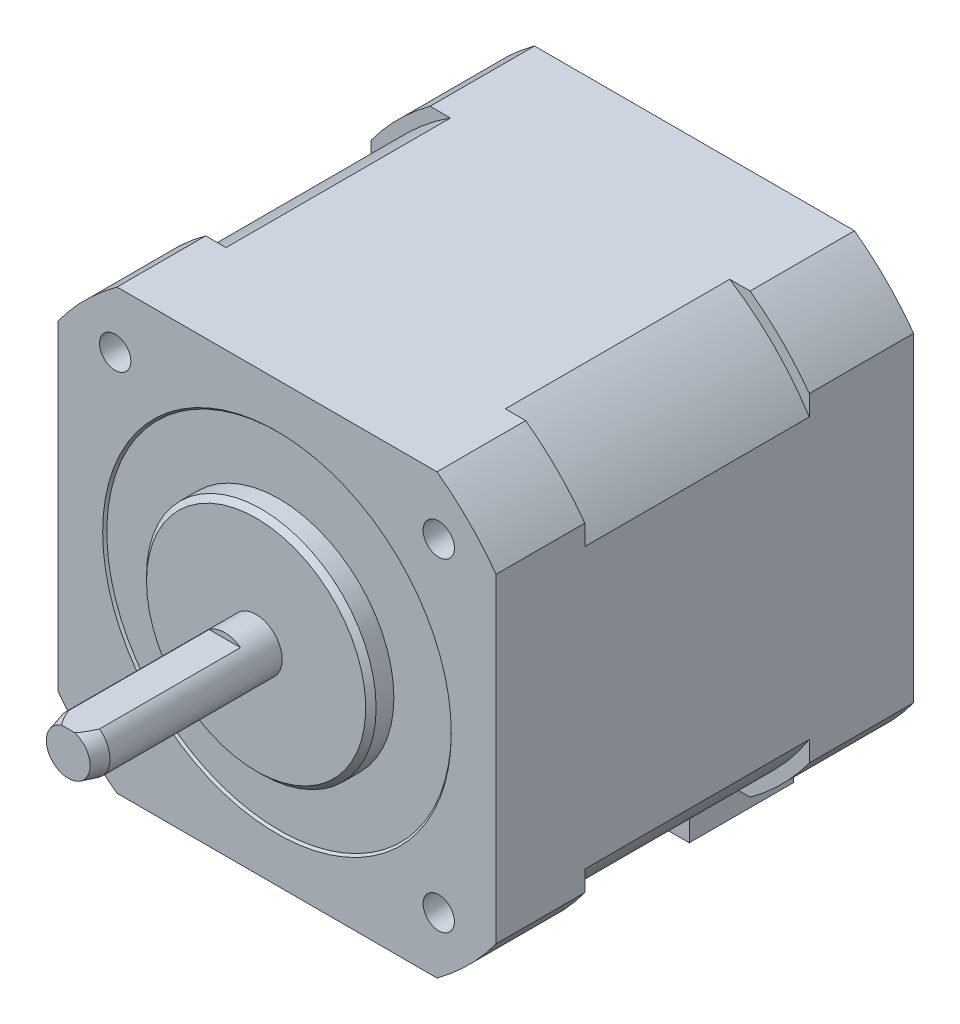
ISO-10303-21;
HEADER;
FILE_DESCRIPTION(('STEP AP214'),'2;1');
FILE_NAME('part.step','',(''),(''),'','','');
FILE_SCHEMA(('AUTOMOTIVE_DESIGN { 1 0 10303 214 1 1 1 1 }'));
ENDSEC;
DATA;
#1=APPLICATION_CONTEXT('core data for automotive mechanical design processes');
#2=APPLICATION_PROTOCOL_DEFINITION('international standard','automotive_design',2000,#1);
#3=PRODUCT_CONTEXT('',#1,'mechanical');
#4=PRODUCT('Part','Part','',(#3));
#5=PRODUCT_RELATED_PRODUCT_CATEGORY('part','',(#4));
#6=PRODUCT_DEFINITION_FORMATION('','',#4);
#7=PRODUCT_DEFINITION_CONTEXT('part definition',#1,'design');
#8=PRODUCT_DEFINITION('design','',#6,#7);
#9=PRODUCT_DEFINITION_SHAPE('','',#8);
#10=(LENGTH_UNIT() NAMED_UNIT(*) SI_UNIT(.MILLI.,.METRE.));
#11=(NAMED_UNIT(*) PLANE_ANGLE_UNIT() SI_UNIT($,.RADIAN.));
#12=(NAMED_UNIT(*) SI_UNIT($,.STERADIAN.) SOLID_ANGLE_UNIT());
#13=UNCERTAINTY_MEASURE_WITH_UNIT(LENGTH_MEASURE(1.E-05),#10,'distance_accuracy_value','');
#14=(GEOMETRIC_REPRESENTATION_CONTEXT(3) GLOBAL_UNCERTAINTY_ASSIGNED_CONTEXT((#13)) GLOBAL_UNIT_ASSIGNED_CONTEXT((#10,
#11,#12)) REPRESENTATION_CONTEXT('',''));
#15=CARTESIAN_POINT('',(0.,0.,0.));
#16=DIRECTION('',(0.,0.,1.));
#17=DIRECTION('',(1.,0.,0.));
#18=AXIS2_PLACEMENT_3D('',#15,#16,#17);
#19=CARTESIAN_POINT('',(21.,-21.,-10.5));
#20=DIRECTION('',(0.,1.,0.));
#21=DIRECTION('',(-1.,0.,0.));
#22=AXIS2_PLACEMENT_3D('',#19,#20,#21);
#23=PLANE('',#22);
#24=DIRECTION('',(0.,0.,-1.));
#25=VECTOR('',#24,1.);
#26=CARTESIAN_POINT('',(-9.5,-21.,-32.));
#27=LINE('',#26,#25);
#28=CARTESIAN_POINT('',(-9.5,-21.,-32.));
#29=VERTEX_POINT('',#28);
#30=CARTESIAN_POINT('',(-9.5,-21.0000000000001,-42.));
#31=VERTEX_POINT('',#30);
#32=EDGE_CURVE('E42',#29,#31,#27,.T.);
#33=ORIENTED_EDGE('',*,*,#32,.F.);
#34=DIRECTION('',(-1.,0.,0.));
#35=VECTOR('',#34,1.);
#36=CARTESIAN_POINT('',(-9.5,-21.,-32.));
#37=LINE('',#36,#35);
#38=CARTESIAN_POINT('',(9.5,-21.,-32.));
#39=VERTEX_POINT('',#38);
#40=EDGE_CURVE('E262',#39,#29,#37,.T.);
#41=ORIENTED_EDGE('',*,*,#40,.F.);
#42=DIRECTION('',(0.,0.,1.));
#43=VECTOR('',#42,1.);
#44=CARTESIAN_POINT('',(9.5,-21.,-32.));
#45=LINE('',#44,#43);
#46=CARTESIAN_POINT('',(9.5,-21.,-42.));
#47=VERTEX_POINT('',#46);
#48=EDGE_CURVE('E278',#47,#39,#45,.T.);
#49=ORIENTED_EDGE('',*,*,#48,.F.);
#50=DIRECTION('',(-1.,0.,0.));
#51=VECTOR('',#50,1.);
#52=CARTESIAN_POINT('',(15.3297097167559,-21.,-42.));
#53=LINE('',#52,#51);
#54=CARTESIAN_POINT('',(15.3297097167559,-21.,-42.));
#55=VERTEX_POINT('',#54);
#56=EDGE_CURVE('E283',#55,#47,#53,.T.);
#57=ORIENTED_EDGE('',*,*,#56,.F.);
#58=DIRECTION('',(0.,0.,1.));
#59=VECTOR('',#58,1.);
#60=CARTESIAN_POINT('',(15.3297097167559,-21.,-42.));
#61=LINE('',#60,#59);
#62=CARTESIAN_POINT('',(15.3297097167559,-21.,-32.));
#63=VERTEX_POINT('',#62);
#64=EDGE_CURVE('E356',#55,#63,#61,.T.);
#65=ORIENTED_EDGE('',*,*,#64,.T.);
#66=DIRECTION('',(-1.,0.,0.));
#67=VECTOR('',#66,1.);
#68=CARTESIAN_POINT('',(-13.3794618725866,-21.,-32.));
#69=LINE('',#68,#67);
#70=CARTESIAN_POINT('',(13.3794618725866,-21.,-32.));
#71=VERTEX_POINT('',#70);
#72=EDGE_CURVE('E317',#63,#71,#69,.T.);
#73=ORIENTED_EDGE('',*,*,#72,.T.);
#74=DIRECTION('',(0.,0.,1.));
#75=VECTOR('',#74,1.);
#76=CARTESIAN_POINT('',(13.3794618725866,-21.,-32.));
#77=LINE('',#76,#75);
#78=CARTESIAN_POINT('',(13.3794618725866,-21.,-10.5));
#79=VERTEX_POINT('',#78);
#80=EDGE_CURVE('E724',#71,#79,#77,.T.);
#81=ORIENTED_EDGE('',*,*,#80,.T.);
#82=DIRECTION('',(-1.,0.,0.));
#83=VECTOR('',#82,1.);
#84=CARTESIAN_POINT('',(21.,-21.,-10.5));
#85=LINE('',#84,#83);
#86=CARTESIAN_POINT('',(15.3297097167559,-21.,-10.5));
#87=VERTEX_POINT('',#86);
#88=EDGE_CURVE('E563',#87,#79,#85,.T.);
#89=ORIENTED_EDGE('',*,*,#88,.F.);
#90=DIRECTION('',(0.,0.,1.));
#91=VECTOR('',#90,1.);
#92=CARTESIAN_POINT('',(15.3297097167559,-21.,-36.));
#93=LINE('',#92,#91);
#94=CARTESIAN_POINT('',(15.3297097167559,-21.,-2.));
#95=VERTEX_POINT('',#94);
#96=EDGE_CURVE('E625',#95,#87,#93,.F.);
#97=ORIENTED_EDGE('',*,*,#96,.F.);
#98=DIRECTION('',(-1.,0.,0.));
#99=VECTOR('',#98,1.);
#100=CARTESIAN_POINT('',(21.,-21.,-2.));
#101=LINE('',#100,#99);
#102=CARTESIAN_POINT('',(-15.3297097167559,-21.,-2.));
#103=VERTEX_POINT('',#102);
#104=EDGE_CURVE('E571',#95,#103,#101,.T.);
#105=ORIENTED_EDGE('',*,*,#104,.T.);
#106=DIRECTION('',(0.,0.,1.));
#107=VECTOR('',#106,1.);
#108=CARTESIAN_POINT('',(-15.3297097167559,-21.,-36.));
#109=LINE('',#108,#107);
#110=CARTESIAN_POINT('',(-15.3297097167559,-21.,-10.5));
#111=VERTEX_POINT('',#110);
#112=EDGE_CURVE('E629',#111,#103,#109,.T.);
#113=ORIENTED_EDGE('',*,*,#112,.F.);
#114=CARTESIAN_POINT('',(-13.3794618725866,-21.,-10.5));
#115=VERTEX_POINT('',#114);
#116=EDGE_CURVE('E568',#115,#111,#85,.T.);
#117=ORIENTED_EDGE('',*,*,#116,.F.);
#118=DIRECTION('',(0.,0.,1.));
#119=VECTOR('',#118,1.);
#120=CARTESIAN_POINT('',(-13.3794618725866,-21.,-32.));
#121=LINE('',#120,#119);
#122=CARTESIAN_POINT('',(-13.3794618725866,-21.,-32.));
#123=VERTEX_POINT('',#122);
#124=EDGE_CURVE('E725',#123,#115,#121,.T.);
#125=ORIENTED_EDGE('',*,*,#124,.F.);
#126=CARTESIAN_POINT('',(-15.3297097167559,-21.,-32.));
#127=VERTEX_POINT('',#126);
#128=EDGE_CURVE('E315',#123,#127,#69,.T.);
#129=ORIENTED_EDGE('',*,*,#128,.T.);
#130=DIRECTION('',(0.,0.,1.));
#131=VECTOR('',#130,1.);
#132=CARTESIAN_POINT('',(-15.3297097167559,-21.,-42.));
#133=LINE('',#132,#131);
#134=CARTESIAN_POINT('',(-15.3297097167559,-21.,-42.));
#135=VERTEX_POINT('',#134);
#136=EDGE_CURVE('E353',#135,#127,#133,.T.);
#137=ORIENTED_EDGE('',*,*,#136,.F.);
#138=EDGE_CURVE('E60',#31,#135,#53,.T.);
#139=ORIENTED_EDGE('',*,*,#138,.F.);
#140=EDGE_LOOP('',(#33,#41,#49,#57,#65,#73,#81,#89,#97,#105,#113,#117,#125,#129,#137,#139));
#141=FACE_BOUND('',#140,.T.);
#142=ADVANCED_FACE('F38',(#141),#23,.F.);
#143=CARTESIAN_POINT('',(0.,0.,18.));
#144=DIRECTION('',(0.,0.,-1.));
#145=DIRECTION('',(-1.,0.,0.));
#146=AXIS2_PLACEMENT_3D('',#143,#144,#145);
#147=CYLINDRICAL_SURFACE('',#146,2.5);
#148=CARTESIAN_POINT('',(0.,0.,16.4999999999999));
#149=DIRECTION('',(0.,0.,1.));
#150=DIRECTION('',(1.,0.,0.));
#151=AXIS2_PLACEMENT_3D('',#148,#149,#150);
#152=CIRCLE('',#151,2.5);
#153=CARTESIAN_POINT('',(1.5,2.,16.4999999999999));
#154=VERTEX_POINT('',#153);
#155=CARTESIAN_POINT('',(-1.49999999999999,2.,16.4999999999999));
#156=VERTEX_POINT('',#155);
#157=EDGE_CURVE('E407',#154,#156,#152,.F.);
#158=ORIENTED_EDGE('',*,*,#157,.T.);
#159=DIRECTION('',(0.,0.,-1.));
#160=VECTOR('',#159,1.);
#161=CARTESIAN_POINT('',(-1.5,2.,18.));
#162=LINE('',#161,#160);
#163=CARTESIAN_POINT('',(-1.5,2.,3.));
#164=VERTEX_POINT('',#163);
#165=EDGE_CURVE('E303',#156,#164,#162,.T.);
#166=ORIENTED_EDGE('',*,*,#165,.T.);
#167=CARTESIAN_POINT('',(0.,0.,3.));
#168=DIRECTION('',(0.,0.,1.));
#169=DIRECTION('',(1.,0.,0.));
#170=AXIS2_PLACEMENT_3D('',#167,#168,#169);
#171=CIRCLE('',#170,2.5);
#172=CARTESIAN_POINT('',(1.5,2.,3.));
#173=VERTEX_POINT('',#172);
#174=EDGE_CURVE('E419',#173,#164,#171,.T.);
#175=ORIENTED_EDGE('',*,*,#174,.F.);
#176=DIRECTION('',(0.,0.,-1.));
#177=VECTOR('',#176,1.);
#178=CARTESIAN_POINT('',(1.5,2.,18.));
#179=LINE('',#178,#177);
#180=EDGE_CURVE('E756',#173,#154,#179,.F.);
#181=ORIENTED_EDGE('',*,*,#180,.T.);
#182=EDGE_LOOP('',(#158,#166,#175,#181));
#183=FACE_BOUND('',#182,.T.);
#184=CARTESIAN_POINT('',(0.,0.,0.));
#185=DIRECTION('',(0.,0.,-1.));
#186=DIRECTION('',(-1.,0.,0.));
#187=AXIS2_PLACEMENT_3D('',#184,#185,#186);
#188=CIRCLE('',#187,2.5);
#189=CARTESIAN_POINT('',(-2.5,0.,0.));
#190=VERTEX_POINT('',#189);
#191=EDGE_CURVE('E560',#190,#190,#188,.T.);
#192=ORIENTED_EDGE('',*,*,#191,.F.);
#193=EDGE_LOOP('',(#192));
#194=FACE_BOUND('',#193,.T.);
#195=ADVANCED_FACE('F528',(#183,#194),#147,.T.);
#196=CARTESIAN_POINT('',(0.,0.,18.));
#197=DIRECTION('',(0.,0.,1.));
#198=DIRECTION('',(1.,0.,0.));
#199=AXIS2_PLACEMENT_3D('',#196,#197,#198);
#200=PLANE('',#199);
#201=DIRECTION('',(1.,0.,0.));
#202=VECTOR('',#201,1.);
#203=CARTESIAN_POINT('',(-4.72781232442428,2.,18.));
#204=LINE('',#203,#202);
#205=CARTESIAN_POINT('',(-0.633974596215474,2.,18.));
#206=VERTEX_POINT('',#205);
#207=CARTESIAN_POINT('',(0.633974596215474,2.,18.));
#208=VERTEX_POINT('',#207);
#209=EDGE_CURVE('E759',#206,#208,#204,.T.);
#210=ORIENTED_EDGE('',*,*,#209,.F.);
#211=CARTESIAN_POINT('',(0.,0.,18.));
#212=DIRECTION('',(0.,0.,1.));
#213=DIRECTION('',(1.,0.,0.));
#214=AXIS2_PLACEMENT_3D('',#211,#212,#213);
#215=CIRCLE('',#214,2.09807621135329);
#216=EDGE_CURVE('E404',#206,#208,#215,.T.);
#217=ORIENTED_EDGE('',*,*,#216,.T.);
#218=EDGE_LOOP('',(#210,#217));
#219=FACE_BOUND('',#218,.T.);
#220=ADVANCED_FACE('F543',(#219),#200,.T.);
#221=CARTESIAN_POINT('',(0.,0.,0.));
#222=DIRECTION('',(0.,0.,-1.));
#223=DIRECTION('',(-1.,0.,0.));
#224=AXIS2_PLACEMENT_3D('',#221,#222,#223);
#225=PLANE('',#224);
#226=CARTESIAN_POINT('',(0.,0.,0.));
#227=DIRECTION('',(0.,0.,-1.));
#228=DIRECTION('',(-1.,0.,0.));
#229=AXIS2_PLACEMENT_3D('',#226,#227,#228);
#230=CIRCLE('',#229,10.5);
#231=CARTESIAN_POINT('',(-10.5,0.,0.));
#232=VERTEX_POINT('',#231);
#233=EDGE_CURVE('E48',#232,#232,#230,.F.);
#234=ORIENTED_EDGE('',*,*,#233,.T.);
#235=EDGE_LOOP('',(#234));
#236=FACE_BOUND('',#235,.T.);
#237=ORIENTED_EDGE('',*,*,#191,.T.);
#238=EDGE_LOOP('',(#237));
#239=FACE_BOUND('',#238,.T.);
#240=ADVANCED_FACE('F539',(#236,#239),#225,.F.);
#241=CARTESIAN_POINT('',(0.,0.,-2.));
#242=DIRECTION('',(0.,0.,1.));
#243=DIRECTION('',(1.,0.,0.));
#244=AXIS2_PLACEMENT_3D('',#241,#242,#243);
#245=CYLINDRICAL_SURFACE('',#244,11.);
#246=CARTESIAN_POINT('',(0.,0.,-0.499999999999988));
#247=DIRECTION('',(0.,0.,-1.));
#248=DIRECTION('',(-1.,0.,0.));
#249=AXIS2_PLACEMENT_3D('',#246,#247,#248);
#250=CIRCLE('',#249,11.);
#251=CARTESIAN_POINT('',(-11.,0.,-0.499999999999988));
#252=VERTEX_POINT('',#251);
#253=EDGE_CURVE('E825',#252,#252,#250,.T.);
#254=ORIENTED_EDGE('',*,*,#253,.T.);
#255=EDGE_LOOP('',(#254));
#256=FACE_BOUND('',#255,.T.);
#257=CARTESIAN_POINT('',(0.,0.,-2.2));
#258=DIRECTION('',(0.,0.,1.));
#259=DIRECTION('',(1.,0.,0.));
#260=AXIS2_PLACEMENT_3D('',#257,#258,#259);
#261=CIRCLE('',#260,11.);
#262=CARTESIAN_POINT('',(11.,0.,-2.2));
#263=VERTEX_POINT('',#262);
#264=EDGE_CURVE('E265',#263,#263,#261,.T.);
#265=ORIENTED_EDGE('',*,*,#264,.T.);
#266=EDGE_LOOP('',(#265));
#267=FACE_BOUND('',#266,.T.);
#268=ADVANCED_FACE('F542',(#256,#267),#245,.T.);
#269=CARTESIAN_POINT('',(0.,0.,18.));
#270=DIRECTION('',(0.,0.,-1.));
#271=DIRECTION('',(-1.,0.,0.));
#272=AXIS2_PLACEMENT_3D('',#269,#270,#271);
#273=CONICAL_SURFACE('',#272,2.09807621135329,0.261799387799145);
#274=CARTESIAN_POINT('',(-2.67411513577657,2.,13.3677080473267));
#275=CARTESIAN_POINT('',(-2.63311786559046,2.,13.4902257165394));
#276=CARTESIAN_POINT('',(-2.59182160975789,2.,13.6126436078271));
#277=CARTESIAN_POINT('',(-2.50853023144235,2.,13.8572444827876));
#278=CARTESIAN_POINT('',(-2.46653509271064,2.,13.9794274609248));
#279=CARTESIAN_POINT('',(-2.33928264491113,2.,14.34576464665));
#280=CARTESIAN_POINT('',(-2.25282589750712,2.,14.5895039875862));
#281=CARTESIAN_POINT('',(-2.07457613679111,2.,15.0781045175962));
#282=CARTESIAN_POINT('',(-1.98273458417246,2.,15.3229481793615));
#283=CARTESIAN_POINT('',(-1.84011140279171,2.,15.688262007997));
#284=CARTESIAN_POINT('',(-1.79177038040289,2.,15.8096838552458));
#285=CARTESIAN_POINT('',(-1.6930545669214,2.,16.0516959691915));
#286=CARTESIAN_POINT('',(-1.64267985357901,2.,16.1722862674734));
#287=CARTESIAN_POINT('',(-1.53950262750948,2.,16.4120087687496));
#288=CARTESIAN_POINT('',(-1.4867076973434,2.,16.5311442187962));
#289=CARTESIAN_POINT('',(-1.37773401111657,2.,16.7679408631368));
#290=CARTESIAN_POINT('',(-1.32155357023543,2.,16.8856012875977));
#291=CARTESIAN_POINT('',(-1.20458285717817,2.,17.1187131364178));
#292=CARTESIAN_POINT('',(-1.14379017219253,2.,17.2341633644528));
#293=CARTESIAN_POINT('',(-1.01570284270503,2.,17.4612984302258));
#294=CARTESIAN_POINT('',(-0.948415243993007,2.,17.5729871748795));
#295=CARTESIAN_POINT('',(-0.817363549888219,2.,17.7692701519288));
#296=CARTESIAN_POINT('',(-0.755348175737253,2.,17.8549879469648));
#297=CARTESIAN_POINT('',(-0.654778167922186,2.,17.9770588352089));
#298=CARTESIAN_POINT('',(-0.620094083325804,2.,18.0165731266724));
#299=CARTESIAN_POINT('',(-0.547506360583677,2.,18.092493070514));
#300=CARTESIAN_POINT('',(-0.509607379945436,2.,18.1289030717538));
#301=CARTESIAN_POINT('',(-0.439829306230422,2.,18.1884315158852));
#302=CARTESIAN_POINT('',(-0.40884422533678,2.,18.212585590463));
#303=CARTESIAN_POINT('',(-0.344218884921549,2.,18.2572111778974));
#304=CARTESIAN_POINT('',(-0.310575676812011,2.,18.2776785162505));
#305=CARTESIAN_POINT('',(-0.240012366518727,2.,18.3136158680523));
#306=CARTESIAN_POINT('',(-0.203051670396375,2.,18.3290087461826));
#307=CARTESIAN_POINT('',(-0.126881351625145,2.,18.3523462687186));
#308=CARTESIAN_POINT('',(-0.0876800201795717,2.,18.3603166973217));
#309=CARTESIAN_POINT('',(-0.0127311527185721,2.,18.367039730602));
#310=CARTESIAN_POINT('',(0.0229341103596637,2.,18.3666919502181));
#311=CARTESIAN_POINT('',(0.0935290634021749,2.,18.3590326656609));
#312=CARTESIAN_POINT('',(0.128457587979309,2.,18.3517108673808));
#313=CARTESIAN_POINT('',(0.201815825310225,2.,18.329553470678));
#314=CARTESIAN_POINT('',(0.239935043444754,2.,18.3137192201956));
#315=CARTESIAN_POINT('',(0.313185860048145,2.,18.276283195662));
#316=CARTESIAN_POINT('',(0.348311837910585,2.,18.2546708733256));
#317=CARTESIAN_POINT('',(0.443923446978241,2.,18.1877621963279));
#318=CARTESIAN_POINT('',(0.501075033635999,2.,18.1377652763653));
#319=CARTESIAN_POINT('',(0.581429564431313,2.,18.0575943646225));
#320=CARTESIAN_POINT('',(0.60737285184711,2.,18.0299378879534));
#321=CARTESIAN_POINT('',(0.657731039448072,2.,17.9732675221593));
#322=CARTESIAN_POINT('',(0.682146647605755,2.,17.9442542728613));
#323=CARTESIAN_POINT('',(0.749893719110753,2.,17.8601101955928));
#324=CARTESIAN_POINT('',(0.791668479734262,2.,17.8037362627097));
#325=CARTESIAN_POINT('',(0.871939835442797,2.,17.6886841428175));
#326=CARTESIAN_POINT('',(0.91043426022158,2.,17.6300044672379));
#327=CARTESIAN_POINT('',(0.984949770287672,2.,17.5109259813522));
#328=CARTESIAN_POINT('',(1.02096523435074,2.,17.4505236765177));
#329=CARTESIAN_POINT('',(1.09096213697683,2.,17.3285472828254));
#330=CARTESIAN_POINT('',(1.12494324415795,2.,17.2669730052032));
#331=CARTESIAN_POINT('',(1.22495399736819,2.,17.0799665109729));
#332=CARTESIAN_POINT('',(1.2884786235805,2.,16.9531970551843));
#333=CARTESIAN_POINT('',(1.41085483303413,2.,16.6976781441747));
#334=CARTESIAN_POINT('',(1.46971282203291,2.,16.5689317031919));
#335=CARTESIAN_POINT('',(1.58310001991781,2.,16.3121463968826));
#336=CARTESIAN_POINT('',(1.63768554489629,2.,16.1841322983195));
#337=CARTESIAN_POINT('',(1.7443631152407,2.,15.9270663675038));
#338=CARTESIAN_POINT('',(1.79645500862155,2.,15.7980144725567));
#339=CARTESIAN_POINT('',(1.94989108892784,2.,15.4094944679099));
#340=CARTESIAN_POINT('',(2.04830566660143,2.,15.1488712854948));
#341=CARTESIAN_POINT('',(2.23648040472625,2.,14.6352664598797));
#342=CARTESIAN_POINT('',(2.32642514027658,2.,14.3823515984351));
#343=CARTESIAN_POINT('',(2.45867006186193,2.,14.0022493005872));
#344=CARTESIAN_POINT('',(2.50227709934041,2.,13.8755147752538));
#345=CARTESIAN_POINT('',(2.58873482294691,2.,13.6217918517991));
#346=CARTESIAN_POINT('',(2.63158553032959,2.,13.4948034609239));
#347=CARTESIAN_POINT('',(2.67411513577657,2.,13.3677080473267));
#348=B_SPLINE_CURVE_WITH_KNOTS('',3,(#274,#275,#276,#277,#278,#279,#280,#281,#282,#283,#284,
#285,#286,#287,#288,#289,#290,#291,#292,#293,#294,#295,#296,#297,#298,#299,#300,#301,#302,#303,
#304,#305,#306,#307,#308,#309,#310,#311,#312,#313,#314,#315,#316,#317,#318,#319,#320,#321,#322,
#323,#324,#325,#326,#327,#328,#329,#330,#331,#332,#333,#334,#335,#336,#337,#338,#339,#340,#341,
#342,#343,#344,#345,#346,#347),.UNSPECIFIED.,.F.,.F.,(4,2,2,2,2,2,2,2,2,2,2,2,2,2,2,2,2,2,2,2,2,
2,2,2,2,2,2,2,2,2,2,2,2,2,2,2,4),(0.,0.387584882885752,0.775178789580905,1.5510087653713,
2.33544116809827,2.72750017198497,3.11954420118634,3.51043426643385,3.90152049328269,
4.2928127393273,4.68368517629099,5.00048531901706,5.15809093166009,5.31547199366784,
5.4331414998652,5.55094341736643,5.67046127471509,5.78956238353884,5.89584731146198,
6.00228936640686,6.12543181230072,6.24880061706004,6.47525140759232,6.58900607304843,
6.70270762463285,6.91302983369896,7.12349013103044,7.33441292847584,7.54536999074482,
7.97059745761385,8.3952307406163,8.81269313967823,9.23018095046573,10.0658395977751,
10.8711084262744,11.2731870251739,11.675254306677),.UNSPECIFIED.);
#349=EDGE_CURVE('E418',#156,#206,#348,.T.);
#350=ORIENTED_EDGE('',*,*,#349,.F.);
#351=ORIENTED_EDGE('',*,*,#157,.F.);
#352=EDGE_CURVE('E411',#208,#154,#348,.T.);
#353=ORIENTED_EDGE('',*,*,#352,.F.);
#354=ORIENTED_EDGE('',*,*,#216,.F.);
#355=EDGE_LOOP('',(#350,#351,#353,#354));
#356=FACE_BOUND('',#355,.T.);
#357=ADVANCED_FACE('F421',(#356),#273,.T.);
#358=CARTESIAN_POINT('',(0.,0.,3.));
#359=DIRECTION('',(0.,0.,1.));
#360=DIRECTION('',(1.,0.,0.));
#361=AXIS2_PLACEMENT_3D('',#358,#359,#360);
#362=PLANE('',#361);
#363=ORIENTED_EDGE('',*,*,#174,.T.);
#364=DIRECTION('',(1.,0.,0.));
#365=VECTOR('',#364,1.);
#366=CARTESIAN_POINT('',(-4.72781232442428,2.,3.));
#367=LINE('',#366,#365);
#368=EDGE_CURVE('E758',#164,#173,#367,.T.);
#369=ORIENTED_EDGE('',*,*,#368,.T.);
#370=EDGE_LOOP('',(#363,#369));
#371=FACE_BOUND('',#370,.T.);
#372=ADVANCED_FACE('F430',(#371),#362,.T.);
#373=CARTESIAN_POINT('',(-4.72781232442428,2.,3.));
#374=DIRECTION('',(0.,-1.,0.));
#375=DIRECTION('',(0.,0.,-1.));
#376=AXIS2_PLACEMENT_3D('',#373,#374,#375);
#377=PLANE('',#376);
#378=ORIENTED_EDGE('',*,*,#349,.T.);
#379=ORIENTED_EDGE('',*,*,#209,.T.);
#380=ORIENTED_EDGE('',*,*,#352,.T.);
#381=ORIENTED_EDGE('',*,*,#180,.F.);
#382=ORIENTED_EDGE('',*,*,#368,.F.);
#383=ORIENTED_EDGE('',*,*,#165,.F.);
#384=EDGE_LOOP('',(#378,#379,#380,#381,#382,#383));
#385=FACE_BOUND('',#384,.T.);
#386=ADVANCED_FACE('F424',(#385),#377,.F.);
#387=CARTESIAN_POINT('',(0.,0.,-2.2));
#388=DIRECTION('',(0.,0.,1.));
#389=DIRECTION('',(1.,0.,0.));
#390=AXIS2_PLACEMENT_3D('',#387,#388,#389);
#391=PLANE('',#390);
#392=ORIENTED_EDGE('',*,*,#264,.F.);
#393=EDGE_LOOP('',(#392));
#394=FACE_BOUND('',#393,.T.);
#395=CARTESIAN_POINT('',(0.,0.,-2.2));
#396=DIRECTION('',(0.,0.,1.));
#397=DIRECTION('',(1.,0.,0.));
#398=AXIS2_PLACEMENT_3D('',#395,#396,#397);
#399=CIRCLE('',#398,16.5);
#400=CARTESIAN_POINT('',(16.5,0.,-2.2));
#401=VERTEX_POINT('',#400);
#402=EDGE_CURVE('E268',#401,#401,#399,.T.);
#403=ORIENTED_EDGE('',*,*,#402,.T.);
#404=EDGE_LOOP('',(#403));
#405=FACE_BOUND('',#404,.T.);
#406=ADVANCED_FACE('F429',(#394,#405),#391,.T.);
#407=CARTESIAN_POINT('',(-21.,-21.,-10.5));
#408=DIRECTION('',(0.,0.,-1.));
#409=DIRECTION('',(-1.,0.,0.));
#410=AXIS2_PLACEMENT_3D('',#407,#408,#409);
#411=PLANE('',#410);
#412=CARTESIAN_POINT('',(0.,0.,-10.5));
#413=DIRECTION('',(0.,0.,-1.));
#414=DIRECTION('',(-1.,0.,0.));
#415=AXIS2_PLACEMENT_3D('',#412,#413,#414);
#416=CIRCLE('',#415,24.9);
#417=CARTESIAN_POINT('',(13.3794618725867,21.,-10.5));
#418=VERTEX_POINT('',#417);
#419=CARTESIAN_POINT('',(21.,13.3794618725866,-10.5));
#420=VERTEX_POINT('',#419);
#421=EDGE_CURVE('E402',#418,#420,#416,.T.);
#422=ORIENTED_EDGE('',*,*,#421,.F.);
#423=DIRECTION('',(1.,0.,0.));
#424=VECTOR('',#423,1.);
#425=CARTESIAN_POINT('',(21.,21.,-10.5));
#426=LINE('',#425,#424);
#427=CARTESIAN_POINT('',(15.3297097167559,21.,-10.5));
#428=VERTEX_POINT('',#427);
#429=EDGE_CURVE('E577',#418,#428,#426,.T.);
#430=ORIENTED_EDGE('',*,*,#429,.T.);
#431=CARTESIAN_POINT('',(0.,0.,-10.5));
#432=DIRECTION('',(0.,0.,-1.));
#433=DIRECTION('',(-1.,0.,0.));
#434=AXIS2_PLACEMENT_3D('',#431,#432,#433);
#435=CIRCLE('',#434,26.);
#436=CARTESIAN_POINT('',(21.,15.3297097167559,-10.5));
#437=VERTEX_POINT('',#436);
#438=EDGE_CURVE('E605',#428,#437,#435,.T.);
#439=ORIENTED_EDGE('',*,*,#438,.T.);
#440=DIRECTION('',(0.,-1.,0.));
#441=VECTOR('',#440,1.);
#442=CARTESIAN_POINT('',(21.,21.,-10.5));
#443=LINE('',#442,#441);
#444=EDGE_CURVE('E599',#437,#420,#443,.T.);
#445=ORIENTED_EDGE('',*,*,#444,.T.);
#446=EDGE_LOOP('',(#422,#430,#439,#445));
#447=FACE_BOUND('',#446,.T.);
#448=ADVANCED_FACE('F500',(#447),#411,.T.);
#449=CARTESIAN_POINT('',(0.,0.,-32.));
#450=DIRECTION('',(0.,0.,1.));
#451=DIRECTION('',(1.,0.,0.));
#452=AXIS2_PLACEMENT_3D('',#449,#450,#451);
#453=CYLINDRICAL_SURFACE('',#452,24.9);
#454=ORIENTED_EDGE('',*,*,#421,.T.);
#455=DIRECTION('',(0.,0.,1.));
#456=VECTOR('',#455,1.);
#457=CARTESIAN_POINT('',(21.,13.3794618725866,-32.));
#458=LINE('',#457,#456);
#459=CARTESIAN_POINT('',(21.0000000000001,13.3794618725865,-32.));
#460=VERTEX_POINT('',#459);
#461=EDGE_CURVE('E645',#460,#420,#458,.T.);
#462=ORIENTED_EDGE('',*,*,#461,.F.);
#463=CARTESIAN_POINT('',(0.,0.,-32.));
#464=DIRECTION('',(0.,0.,-1.));
#465=DIRECTION('',(-1.,0.,0.));
#466=AXIS2_PLACEMENT_3D('',#463,#464,#465);
#467=CIRCLE('',#466,24.9);
#468=CARTESIAN_POINT('',(13.3794618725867,21.,-32.));
#469=VERTEX_POINT('',#468);
#470=EDGE_CURVE('E668',#469,#460,#467,.T.);
#471=ORIENTED_EDGE('',*,*,#470,.F.);
#472=DIRECTION('',(0.,0.,1.));
#473=VECTOR('',#472,1.);
#474=CARTESIAN_POINT('',(13.3794618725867,21.,-32.));
#475=LINE('',#474,#473);
#476=EDGE_CURVE('E648',#469,#418,#475,.T.);
#477=ORIENTED_EDGE('',*,*,#476,.T.);
#478=EDGE_LOOP('',(#454,#462,#471,#477));
#479=FACE_BOUND('',#478,.T.);
#480=ADVANCED_FACE('F497',(#479),#453,.T.);
#481=CARTESIAN_POINT('',(0.,0.,-32.));
#482=DIRECTION('',(0.,0.,-1.));
#483=DIRECTION('',(-1.,0.,0.));
#484=AXIS2_PLACEMENT_3D('',#481,#482,#483);
#485=PLANE('',#484);
#486=DIRECTION('',(1.,0.,0.));
#487=VECTOR('',#486,1.);
#488=CARTESIAN_POINT('',(13.3794618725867,21.,-32.));
#489=LINE('',#488,#487);
#490=CARTESIAN_POINT('',(15.3297097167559,21.,-32.));
#491=VERTEX_POINT('',#490);
#492=EDGE_CURVE('E335',#469,#491,#489,.T.);
#493=ORIENTED_EDGE('',*,*,#492,.F.);
#494=ORIENTED_EDGE('',*,*,#470,.T.);
#495=DIRECTION('',(0.,-1.,0.));
#496=VECTOR('',#495,1.);
#497=CARTESIAN_POINT('',(21.,-13.3794618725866,-32.));
#498=LINE('',#497,#496);
#499=CARTESIAN_POINT('',(21.,15.3297097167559,-32.));
#500=VERTEX_POINT('',#499);
#501=EDGE_CURVE('E312',#500,#460,#498,.T.);
#502=ORIENTED_EDGE('',*,*,#501,.F.);
#503=CARTESIAN_POINT('',(0.,0.,-32.));
#504=DIRECTION('',(0.,0.,-1.));
#505=DIRECTION('',(-1.,0.,0.));
#506=AXIS2_PLACEMENT_3D('',#503,#504,#505);
#507=CIRCLE('',#506,26.);
#508=EDGE_CURVE('E299',#491,#500,#507,.T.);
#509=ORIENTED_EDGE('',*,*,#508,.F.);
#510=EDGE_LOOP('',(#493,#494,#502,#509));
#511=FACE_BOUND('',#510,.T.);
#512=ADVANCED_FACE('F444',(#511),#485,.F.);
#513=CARTESIAN_POINT('',(0.,0.,-42.));
#514=DIRECTION('',(0.,0.,1.));
#515=DIRECTION('',(1.,0.,0.));
#516=AXIS2_PLACEMENT_3D('',#513,#514,#515);
#517=CYLINDRICAL_SURFACE('',#516,26.);
#518=ORIENTED_EDGE('',*,*,#508,.T.);
#519=DIRECTION('',(0.,0.,1.));
#520=VECTOR('',#519,1.);
#521=CARTESIAN_POINT('',(21.,15.3297097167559,-42.));
#522=LINE('',#521,#520);
#523=CARTESIAN_POINT('',(21.,15.3297097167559,-42.));
#524=VERTEX_POINT('',#523);
#525=EDGE_CURVE('E361',#524,#500,#522,.T.);
#526=ORIENTED_EDGE('',*,*,#525,.F.);
#527=CARTESIAN_POINT('',(0.,0.,-42.));
#528=DIRECTION('',(0.,0.,-1.));
#529=DIRECTION('',(-1.,0.,0.));
#530=AXIS2_PLACEMENT_3D('',#527,#528,#529);
#531=CIRCLE('',#530,26.);
#532=CARTESIAN_POINT('',(15.3297097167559,21.,-42.));
#533=VERTEX_POINT('',#532);
#534=EDGE_CURVE('E750',#533,#524,#531,.T.);
#535=ORIENTED_EDGE('',*,*,#534,.F.);
#536=DIRECTION('',(0.,0.,1.));
#537=VECTOR('',#536,1.);
#538=CARTESIAN_POINT('',(15.3297097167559,21.,-42.));
#539=LINE('',#538,#537);
#540=EDGE_CURVE('E298',#533,#491,#539,.T.);
#541=ORIENTED_EDGE('',*,*,#540,.T.);
#542=EDGE_LOOP('',(#518,#526,#535,#541));
#543=FACE_BOUND('',#542,.T.);
#544=ADVANCED_FACE('F456',(#543),#517,.T.);
#545=CARTESIAN_POINT('',(0.,0.,-10.5));
#546=DIRECTION('',(0.,0.,-1.));
#547=DIRECTION('',(-1.,0.,0.));
#548=AXIS2_PLACEMENT_3D('',#545,#546,#547);
#549=CIRCLE('',#548,24.9);
#550=CARTESIAN_POINT('',(21.,-13.3794618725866,-10.5));
#551=VERTEX_POINT('',#550);
#552=EDGE_CURVE('E389',#551,#79,#549,.T.);
#553=ORIENTED_EDGE('',*,*,#552,.F.);
#554=CARTESIAN_POINT('',(21.,-15.3297097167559,-10.5));
#555=VERTEX_POINT('',#554);
#556=EDGE_CURVE('E594',#551,#555,#443,.T.);
#557=ORIENTED_EDGE('',*,*,#556,.T.);
#558=EDGE_CURVE('E566',#555,#87,#435,.T.);
#559=ORIENTED_EDGE('',*,*,#558,.T.);
#560=ORIENTED_EDGE('',*,*,#88,.T.);
#561=EDGE_LOOP('',(#553,#557,#559,#560));
#562=FACE_BOUND('',#561,.T.);
#563=ADVANCED_FACE('F459',(#562),#411,.T.);
#564=CARTESIAN_POINT('',(0.,0.,-32.));
#565=DIRECTION('',(0.,0.,1.));
#566=DIRECTION('',(1.,0.,0.));
#567=AXIS2_PLACEMENT_3D('',#564,#565,#566);
#568=CYLINDRICAL_SURFACE('',#567,24.9);
#569=ORIENTED_EDGE('',*,*,#552,.T.);
#570=ORIENTED_EDGE('',*,*,#80,.F.);
#571=CARTESIAN_POINT('',(0.,0.,-32.));
#572=DIRECTION('',(0.,0.,-1.));
#573=DIRECTION('',(-1.,0.,0.));
#574=AXIS2_PLACEMENT_3D('',#571,#572,#573);
#575=CIRCLE('',#574,24.9);
#576=CARTESIAN_POINT('',(21.,-13.3794618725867,-32.));
#577=VERTEX_POINT('',#576);
#578=EDGE_CURVE('E397',#577,#71,#575,.T.);
#579=ORIENTED_EDGE('',*,*,#578,.F.);
#580=DIRECTION('',(0.,0.,1.));
#581=VECTOR('',#580,1.);
#582=CARTESIAN_POINT('',(21.,-13.3794618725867,-32.));
#583=LINE('',#582,#581);
#584=EDGE_CURVE('E649',#577,#551,#583,.T.);
#585=ORIENTED_EDGE('',*,*,#584,.T.);
#586=EDGE_LOOP('',(#569,#570,#579,#585));
#587=FACE_BOUND('',#586,.T.);
#588=ADVANCED_FACE('F441',(#587),#568,.T.);
#589=CARTESIAN_POINT('',(21.,-15.3297097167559,-32.));
#590=VERTEX_POINT('',#589);
#591=EDGE_CURVE('E302',#577,#590,#498,.T.);
#592=ORIENTED_EDGE('',*,*,#591,.F.);
#593=ORIENTED_EDGE('',*,*,#578,.T.);
#594=ORIENTED_EDGE('',*,*,#72,.F.);
#595=CARTESIAN_POINT('',(0.,0.,-32.));
#596=DIRECTION('',(0.,0.,-1.));
#597=DIRECTION('',(-1.,0.,0.));
#598=AXIS2_PLACEMENT_3D('',#595,#596,#597);
#599=CIRCLE('',#598,26.);
#600=EDGE_CURVE('E306',#590,#63,#599,.T.);
#601=ORIENTED_EDGE('',*,*,#600,.F.);
#602=EDGE_LOOP('',(#592,#593,#594,#601));
#603=FACE_BOUND('',#602,.T.);
#604=ADVANCED_FACE('F437',(#603),#485,.F.);
#605=CARTESIAN_POINT('',(0.,0.,-42.));
#606=DIRECTION('',(0.,0.,1.));
#607=DIRECTION('',(1.,0.,0.));
#608=AXIS2_PLACEMENT_3D('',#605,#606,#607);
#609=CYLINDRICAL_SURFACE('',#608,26.);
#610=ORIENTED_EDGE('',*,*,#600,.T.);
#611=ORIENTED_EDGE('',*,*,#64,.F.);
#612=CARTESIAN_POINT('',(0.,0.,-42.));
#613=DIRECTION('',(0.,0.,-1.));
#614=DIRECTION('',(-1.,0.,0.));
#615=AXIS2_PLACEMENT_3D('',#612,#613,#614);
#616=CIRCLE('',#615,26.);
#617=CARTESIAN_POINT('',(21.,-15.3297097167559,-42.));
#618=VERTEX_POINT('',#617);
#619=EDGE_CURVE('E284',#618,#55,#616,.T.);
#620=ORIENTED_EDGE('',*,*,#619,.F.);
#621=DIRECTION('',(0.,0.,1.));
#622=VECTOR('',#621,1.);
#623=CARTESIAN_POINT('',(21.,-15.3297097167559,-42.));
#624=LINE('',#623,#622);
#625=EDGE_CURVE('E359',#618,#590,#624,.T.);
#626=ORIENTED_EDGE('',*,*,#625,.T.);
#627=EDGE_LOOP('',(#610,#611,#620,#626));
#628=FACE_BOUND('',#627,.T.);
#629=ADVANCED_FACE('F440',(#628),#609,.T.);
#630=CARTESIAN_POINT('',(0.,0.,-10.5));
#631=DIRECTION('',(0.,0.,-1.));
#632=DIRECTION('',(-1.,0.,0.));
#633=AXIS2_PLACEMENT_3D('',#630,#631,#632);
#634=CIRCLE('',#633,24.9);
#635=CARTESIAN_POINT('',(-21.,-13.3794618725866,-10.5));
#636=VERTEX_POINT('',#635);
#637=EDGE_CURVE('E657',#115,#636,#634,.T.);
#638=ORIENTED_EDGE('',*,*,#637,.F.);
#639=ORIENTED_EDGE('',*,*,#116,.T.);
#640=CARTESIAN_POINT('',(-21.,-15.3297097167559,-10.5));
#641=VERTEX_POINT('',#640);
#642=EDGE_CURVE('E562',#111,#641,#435,.T.);
#643=ORIENTED_EDGE('',*,*,#642,.T.);
#644=DIRECTION('',(0.,1.,0.));
#645=VECTOR('',#644,1.);
#646=CARTESIAN_POINT('',(-21.,21.,-10.5));
#647=LINE('',#646,#645);
#648=EDGE_CURVE('E574',#641,#636,#647,.T.);
#649=ORIENTED_EDGE('',*,*,#648,.T.);
#650=EDGE_LOOP('',(#638,#639,#643,#649));
#651=FACE_BOUND('',#650,.T.);
#652=ADVANCED_FACE('F454',(#651),#411,.T.);
#653=CARTESIAN_POINT('',(0.,0.,-32.));
#654=DIRECTION('',(0.,0.,1.));
#655=DIRECTION('',(1.,0.,0.));
#656=AXIS2_PLACEMENT_3D('',#653,#654,#655);
#657=CYLINDRICAL_SURFACE('',#656,24.9);
#658=ORIENTED_EDGE('',*,*,#637,.T.);
#659=DIRECTION('',(0.,0.,1.));
#660=VECTOR('',#659,1.);
#661=CARTESIAN_POINT('',(-21.,-13.3794618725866,-32.));
#662=LINE('',#661,#660);
#663=CARTESIAN_POINT('',(-21.,-13.3794618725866,-32.));
#664=VERTEX_POINT('',#663);
#665=EDGE_CURVE('E665',#664,#636,#662,.T.);
#666=ORIENTED_EDGE('',*,*,#665,.F.);
#667=CARTESIAN_POINT('',(0.,0.,-32.));
#668=DIRECTION('',(0.,0.,-1.));
#669=DIRECTION('',(-1.,0.,0.));
#670=AXIS2_PLACEMENT_3D('',#667,#668,#669);
#671=CIRCLE('',#670,24.9);
#672=EDGE_CURVE('E401',#123,#664,#671,.T.);
#673=ORIENTED_EDGE('',*,*,#672,.F.);
#674=ORIENTED_EDGE('',*,*,#124,.T.);
#675=EDGE_LOOP('',(#658,#666,#673,#674));
#676=FACE_BOUND('',#675,.T.);
#677=ADVANCED_FACE('F506',(#676),#657,.T.);
#678=ORIENTED_EDGE('',*,*,#128,.F.);
#679=ORIENTED_EDGE('',*,*,#672,.T.);
#680=DIRECTION('',(0.,1.,0.));
#681=VECTOR('',#680,1.);
#682=CARTESIAN_POINT('',(-21.,13.3794618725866,-32.));
#683=LINE('',#682,#681);
#684=CARTESIAN_POINT('',(-21.,-15.3297097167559,-32.));
#685=VERTEX_POINT('',#684);
#686=EDGE_CURVE('E332',#685,#664,#683,.T.);
#687=ORIENTED_EDGE('',*,*,#686,.F.);
#688=CARTESIAN_POINT('',(0.,0.,-32.));
#689=DIRECTION('',(0.,0.,-1.));
#690=DIRECTION('',(-1.,0.,0.));
#691=AXIS2_PLACEMENT_3D('',#688,#689,#690);
#692=CIRCLE('',#691,26.);
#693=EDGE_CURVE('E321',#127,#685,#692,.T.);
#694=ORIENTED_EDGE('',*,*,#693,.F.);
#695=EDGE_LOOP('',(#678,#679,#687,#694));
#696=FACE_BOUND('',#695,.T.);
#697=ADVANCED_FACE('F443',(#696),#485,.F.);
#698=CARTESIAN_POINT('',(0.,0.,-42.));
#699=DIRECTION('',(0.,0.,1.));
#700=DIRECTION('',(1.,0.,0.));
#701=AXIS2_PLACEMENT_3D('',#698,#699,#700);
#702=CYLINDRICAL_SURFACE('',#701,26.);
#703=ORIENTED_EDGE('',*,*,#693,.T.);
#704=DIRECTION('',(0.,0.,1.));
#705=VECTOR('',#704,1.);
#706=CARTESIAN_POINT('',(-21.,-15.3297097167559,-42.));
#707=LINE('',#706,#705);
#708=CARTESIAN_POINT('',(-21.,-15.3297097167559,-42.));
#709=VERTEX_POINT('',#708);
#710=EDGE_CURVE('E350',#709,#685,#707,.T.);
#711=ORIENTED_EDGE('',*,*,#710,.F.);
#712=CARTESIAN_POINT('',(0.,0.,-42.));
#713=DIRECTION('',(0.,0.,-1.));
#714=DIRECTION('',(-1.,0.,0.));
#715=AXIS2_PLACEMENT_3D('',#712,#713,#714);
#716=CIRCLE('',#715,26.);
#717=EDGE_CURVE('E289',#135,#709,#716,.T.);
#718=ORIENTED_EDGE('',*,*,#717,.F.);
#719=ORIENTED_EDGE('',*,*,#136,.T.);
#720=EDGE_LOOP('',(#703,#711,#718,#719));
#721=FACE_BOUND('',#720,.T.);
#722=ADVANCED_FACE('F436',(#721),#702,.T.);
#723=CARTESIAN_POINT('',(0.,0.,-42.));
#724=DIRECTION('',(0.,0.,-1.));
#725=DIRECTION('',(-1.,0.,0.));
#726=AXIS2_PLACEMENT_3D('',#723,#724,#725);
#727=PLANE('',#726);
#728=ORIENTED_EDGE('',*,*,#534,.T.);
#729=DIRECTION('',(0.,-1.,0.));
#730=VECTOR('',#729,1.);
#731=CARTESIAN_POINT('',(21.,15.3297097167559,-42.));
#732=LINE('',#731,#730);
#733=EDGE_CURVE('E751',#524,#618,#732,.T.);
#734=ORIENTED_EDGE('',*,*,#733,.T.);
#735=ORIENTED_EDGE('',*,*,#619,.T.);
#736=ORIENTED_EDGE('',*,*,#56,.T.);
#737=DIRECTION('',(0.,1.,0.));
#738=VECTOR('',#737,1.);
#739=CARTESIAN_POINT('',(9.5,-27.7,-42.));
#740=LINE('',#739,#738);
#741=CARTESIAN_POINT('',(9.5,-27.7,-42.));
#742=VERTEX_POINT('',#741);
#743=EDGE_CURVE('E249',#742,#47,#740,.T.);
#744=ORIENTED_EDGE('',*,*,#743,.F.);
#745=DIRECTION('',(1.,0.,0.));
#746=VECTOR('',#745,1.);
#747=CARTESIAN_POINT('',(-9.5,-27.7,-42.));
#748=LINE('',#747,#746);
#749=CARTESIAN_POINT('',(-9.5,-27.7,-42.));
#750=VERTEX_POINT('',#749);
#751=EDGE_CURVE('E241',#750,#742,#748,.T.);
#752=ORIENTED_EDGE('',*,*,#751,.F.);
#753=DIRECTION('',(0.,1.,0.));
#754=VECTOR('',#753,1.);
#755=CARTESIAN_POINT('',(-9.5,-27.7,-42.));
#756=LINE('',#755,#754);
#757=EDGE_CURVE('E246',#750,#31,#756,.T.);
#758=ORIENTED_EDGE('',*,*,#757,.T.);
#759=ORIENTED_EDGE('',*,*,#138,.T.);
#760=ORIENTED_EDGE('',*,*,#717,.T.);
#761=DIRECTION('',(0.,1.,0.));
#762=VECTOR('',#761,1.);
#763=CARTESIAN_POINT('',(-21.,-15.3297097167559,-42.));
#764=LINE('',#763,#762);
#765=CARTESIAN_POINT('',(-21.,15.3297097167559,-42.));
#766=VERTEX_POINT('',#765);
#767=EDGE_CURVE('E292',#709,#766,#764,.T.);
#768=ORIENTED_EDGE('',*,*,#767,.T.);
#769=CARTESIAN_POINT('',(0.,0.,-42.));
#770=DIRECTION('',(0.,0.,-1.));
#771=DIRECTION('',(-1.,0.,0.));
#772=AXIS2_PLACEMENT_3D('',#769,#770,#771);
#773=CIRCLE('',#772,26.);
#774=CARTESIAN_POINT('',(-15.3297097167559,21.,-42.));
#775=VERTEX_POINT('',#774);
#776=EDGE_CURVE('E294',#766,#775,#773,.T.);
#777=ORIENTED_EDGE('',*,*,#776,.T.);
#778=DIRECTION('',(1.,0.,0.));
#779=VECTOR('',#778,1.);
#780=CARTESIAN_POINT('',(-15.3297097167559,21.,-42.));
#781=LINE('',#780,#779);
#782=EDGE_CURVE('E296',#775,#533,#781,.T.);
#783=ORIENTED_EDGE('',*,*,#782,.T.);
#784=EDGE_LOOP('',(#728,#734,#735,#736,#744,#752,#758,#759,#760,#768,#777,#783));
#785=FACE_BOUND('',#784,.T.);
#786=ADVANCED_FACE('F244',(#785),#727,.T.);
#787=CARTESIAN_POINT('',(0.,0.,-42.));
#788=DIRECTION('',(0.,0.,1.));
#789=DIRECTION('',(1.,0.,0.));
#790=AXIS2_PLACEMENT_3D('',#787,#788,#789);
#791=CYLINDRICAL_SURFACE('',#790,26.);
#792=CARTESIAN_POINT('',(0.,0.,-32.));
#793=DIRECTION('',(0.,0.,-1.));
#794=DIRECTION('',(-1.,0.,0.));
#795=AXIS2_PLACEMENT_3D('',#792,#793,#794);
#796=CIRCLE('',#795,26.);
#797=CARTESIAN_POINT('',(-21.,15.3297097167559,-32.));
#798=VERTEX_POINT('',#797);
#799=CARTESIAN_POINT('',(-15.3297097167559,21.,-32.));
#800=VERTEX_POINT('',#799);
#801=EDGE_CURVE('E328',#798,#800,#796,.T.);
#802=ORIENTED_EDGE('',*,*,#801,.T.);
#803=DIRECTION('',(0.,0.,1.));
#804=VECTOR('',#803,1.);
#805=CARTESIAN_POINT('',(-15.3297097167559,21.,-42.));
#806=LINE('',#805,#804);
#807=EDGE_CURVE('E344',#775,#800,#806,.T.);
#808=ORIENTED_EDGE('',*,*,#807,.F.);
#809=ORIENTED_EDGE('',*,*,#776,.F.);
#810=DIRECTION('',(0.,0.,1.));
#811=VECTOR('',#810,1.);
#812=CARTESIAN_POINT('',(-21.,15.3297097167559,-42.));
#813=LINE('',#812,#811);
#814=EDGE_CURVE('E347',#766,#798,#813,.T.);
#815=ORIENTED_EDGE('',*,*,#814,.T.);
#816=EDGE_LOOP('',(#802,#808,#809,#815));
#817=FACE_BOUND('',#816,.T.);
#818=ADVANCED_FACE('F435',(#817),#791,.T.);
#819=CARTESIAN_POINT('',(-21.,13.3794618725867,-32.));
#820=VERTEX_POINT('',#819);
#821=EDGE_CURVE('E325',#820,#798,#683,.T.);
#822=ORIENTED_EDGE('',*,*,#821,.F.);
#823=CARTESIAN_POINT('',(0.,0.,-32.));
#824=DIRECTION('',(0.,0.,-1.));
#825=DIRECTION('',(-1.,0.,0.));
#826=AXIS2_PLACEMENT_3D('',#823,#824,#825);
#827=CIRCLE('',#826,24.9);
#828=CARTESIAN_POINT('',(-13.3794618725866,21.,-32.));
#829=VERTEX_POINT('',#828);
#830=EDGE_CURVE('E671',#820,#829,#827,.T.);
#831=ORIENTED_EDGE('',*,*,#830,.T.);
#832=EDGE_CURVE('E337',#800,#829,#489,.T.);
#833=ORIENTED_EDGE('',*,*,#832,.F.);
#834=ORIENTED_EDGE('',*,*,#801,.F.);
#835=EDGE_LOOP('',(#822,#831,#833,#834));
#836=FACE_BOUND('',#835,.T.);
#837=ADVANCED_FACE('F447',(#836),#485,.F.);
#838=CARTESIAN_POINT('',(0.,0.,-32.));
#839=DIRECTION('',(0.,0.,1.));
#840=DIRECTION('',(1.,0.,0.));
#841=AXIS2_PLACEMENT_3D('',#838,#839,#840);
#842=CYLINDRICAL_SURFACE('',#841,24.9);
#843=CARTESIAN_POINT('',(0.,0.,-10.5));
#844=DIRECTION('',(0.,0.,-1.));
#845=DIRECTION('',(-1.,0.,0.));
#846=AXIS2_PLACEMENT_3D('',#843,#844,#845);
#847=CIRCLE('',#846,24.9);
#848=CARTESIAN_POINT('',(-21.,13.3794618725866,-10.5));
#849=VERTEX_POINT('',#848);
#850=CARTESIAN_POINT('',(-13.3794618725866,21.,-10.5));
#851=VERTEX_POINT('',#850);
#852=EDGE_CURVE('E642',#849,#851,#847,.T.);
#853=ORIENTED_EDGE('',*,*,#852,.T.);
#854=DIRECTION('',(0.,0.,1.));
#855=VECTOR('',#854,1.);
#856=CARTESIAN_POINT('',(-13.3794618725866,21.,-32.));
#857=LINE('',#856,#855);
#858=EDGE_CURVE('E653',#829,#851,#857,.T.);
#859=ORIENTED_EDGE('',*,*,#858,.F.);
#860=ORIENTED_EDGE('',*,*,#830,.F.);
#861=DIRECTION('',(0.,0.,1.));
#862=VECTOR('',#861,1.);
#863=CARTESIAN_POINT('',(-21.,13.3794618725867,-32.));
#864=LINE('',#863,#862);
#865=EDGE_CURVE('E660',#820,#849,#864,.T.);
#866=ORIENTED_EDGE('',*,*,#865,.T.);
#867=EDGE_LOOP('',(#853,#859,#860,#866));
#868=FACE_BOUND('',#867,.T.);
#869=ADVANCED_FACE('F502',(#868),#842,.T.);
#870=ORIENTED_EDGE('',*,*,#852,.F.);
#871=CARTESIAN_POINT('',(-21.,15.3297097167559,-10.5));
#872=VERTEX_POINT('',#871);
#873=EDGE_CURVE('E578',#849,#872,#647,.T.);
#874=ORIENTED_EDGE('',*,*,#873,.T.);
#875=CARTESIAN_POINT('',(-15.3297097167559,21.,-10.5));
#876=VERTEX_POINT('',#875);
#877=EDGE_CURVE('E408',#872,#876,#435,.T.);
#878=ORIENTED_EDGE('',*,*,#877,.T.);
#879=EDGE_CURVE('E593',#876,#851,#426,.T.);
#880=ORIENTED_EDGE('',*,*,#879,.T.);
#881=EDGE_LOOP('',(#870,#874,#878,#880));
#882=FACE_BOUND('',#881,.T.);
#883=ADVANCED_FACE('F491',(#882),#411,.T.);
#884=CARTESIAN_POINT('',(-15.5,15.5,-6.5));
#885=DIRECTION('',(0.,0.,1.));
#886=DIRECTION('',(1.,0.,0.));
#887=AXIS2_PLACEMENT_3D('',#884,#885,#886);
#888=PLANE('',#887);
#889=CARTESIAN_POINT('',(-15.5,15.5,-6.5));
#890=DIRECTION('',(0.,0.,1.));
#891=DIRECTION('',(1.,0.,0.));
#892=AXIS2_PLACEMENT_3D('',#889,#890,#891);
#893=CIRCLE('',#892,1.5);
#894=CARTESIAN_POINT('',(-14.,15.5,-6.5));
#895=VERTEX_POINT('',#894);
#896=EDGE_CURVE('E386',#895,#895,#893,.T.);
#897=ORIENTED_EDGE('',*,*,#896,.T.);
#898=EDGE_LOOP('',(#897));
#899=FACE_BOUND('',#898,.T.);
#900=ADVANCED_FACE('F483',(#899),#888,.T.);
#901=CARTESIAN_POINT('',(15.5,15.5,-6.5));
#902=DIRECTION('',(0.,0.,1.));
#903=DIRECTION('',(1.,0.,0.));
#904=AXIS2_PLACEMENT_3D('',#901,#902,#903);
#905=PLANE('',#904);
#906=CARTESIAN_POINT('',(15.5,15.5,-6.5));
#907=DIRECTION('',(0.,0.,1.));
#908=DIRECTION('',(1.,0.,0.));
#909=AXIS2_PLACEMENT_3D('',#906,#907,#908);
#910=CIRCLE('',#909,1.5);
#911=CARTESIAN_POINT('',(17.,15.5,-6.5));
#912=VERTEX_POINT('',#911);
#913=EDGE_CURVE('E380',#912,#912,#910,.T.);
#914=ORIENTED_EDGE('',*,*,#913,.T.);
#915=EDGE_LOOP('',(#914));
#916=FACE_BOUND('',#915,.T.);
#917=ADVANCED_FACE('F475',(#916),#905,.T.);
#918=CARTESIAN_POINT('',(15.5,-15.5,-6.5));
#919=DIRECTION('',(0.,0.,1.));
#920=DIRECTION('',(1.,0.,0.));
#921=AXIS2_PLACEMENT_3D('',#918,#919,#920);
#922=PLANE('',#921);
#923=CARTESIAN_POINT('',(15.5,-15.5,-6.5));
#924=DIRECTION('',(0.,0.,1.));
#925=DIRECTION('',(1.,0.,0.));
#926=AXIS2_PLACEMENT_3D('',#923,#924,#925);
#927=CIRCLE('',#926,1.5);
#928=CARTESIAN_POINT('',(17.,-15.5,-6.5));
#929=VERTEX_POINT('',#928);
#930=EDGE_CURVE('E374',#929,#929,#927,.T.);
#931=ORIENTED_EDGE('',*,*,#930,.T.);
#932=EDGE_LOOP('',(#931));
#933=FACE_BOUND('',#932,.T.);
#934=ADVANCED_FACE('F465',(#933),#922,.T.);
#935=CARTESIAN_POINT('',(-15.5,-15.5,-6.5));
#936=DIRECTION('',(0.,0.,1.));
#937=DIRECTION('',(1.,0.,0.));
#938=AXIS2_PLACEMENT_3D('',#935,#936,#937);
#939=PLANE('',#938);
#940=CARTESIAN_POINT('',(-15.5,-15.5,-6.5));
#941=DIRECTION('',(0.,0.,1.));
#942=DIRECTION('',(1.,0.,0.));
#943=AXIS2_PLACEMENT_3D('',#940,#941,#942);
#944=CIRCLE('',#943,1.5);
#945=CARTESIAN_POINT('',(-14.,-15.5,-6.5));
#946=VERTEX_POINT('',#945);
#947=EDGE_CURVE('E367',#946,#946,#944,.T.);
#948=ORIENTED_EDGE('',*,*,#947,.T.);
#949=EDGE_LOOP('',(#948));
#950=FACE_BOUND('',#949,.T.);
#951=ADVANCED_FACE('F461',(#950),#939,.T.);
#952=CARTESIAN_POINT('',(21.,21.,-10.5));
#953=DIRECTION('',(0.,-1.,0.));
#954=DIRECTION('',(0.,0.,-1.));
#955=AXIS2_PLACEMENT_3D('',#952,#953,#954);
#956=PLANE('',#955);
#957=DIRECTION('',(0.,0.,1.));
#958=VECTOR('',#957,1.);
#959=CARTESIAN_POINT('',(15.3297097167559,21.,-36.));
#960=LINE('',#959,#958);
#961=CARTESIAN_POINT('',(15.3297097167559,21.,-2.));
#962=VERTEX_POINT('',#961);
#963=EDGE_CURVE('E611',#428,#962,#960,.T.);
#964=ORIENTED_EDGE('',*,*,#963,.F.);
#965=ORIENTED_EDGE('',*,*,#429,.F.);
#966=ORIENTED_EDGE('',*,*,#476,.F.);
#967=ORIENTED_EDGE('',*,*,#492,.T.);
#968=ORIENTED_EDGE('',*,*,#540,.F.);
#969=ORIENTED_EDGE('',*,*,#782,.F.);
#970=ORIENTED_EDGE('',*,*,#807,.T.);
#971=ORIENTED_EDGE('',*,*,#832,.T.);
#972=ORIENTED_EDGE('',*,*,#858,.T.);
#973=ORIENTED_EDGE('',*,*,#879,.F.);
#974=DIRECTION('',(0.,0.,1.));
#975=VECTOR('',#974,1.);
#976=CARTESIAN_POINT('',(-15.3297097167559,21.,-36.));
#977=LINE('',#976,#975);
#978=CARTESIAN_POINT('',(-15.3297097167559,21.,-2.));
#979=VERTEX_POINT('',#978);
#980=EDGE_CURVE('E619',#979,#876,#977,.F.);
#981=ORIENTED_EDGE('',*,*,#980,.F.);
#982=DIRECTION('',(1.,0.,0.));
#983=VECTOR('',#982,1.);
#984=CARTESIAN_POINT('',(21.,21.,-2.));
#985=LINE('',#984,#983);
#986=EDGE_CURVE('E618',#979,#962,#985,.T.);
#987=ORIENTED_EDGE('',*,*,#986,.T.);
#988=EDGE_LOOP('',(#964,#965,#966,#967,#968,#969,#970,#971,#972,#973,#981,#987));
#989=FACE_BOUND('',#988,.T.);
#990=ADVANCED_FACE('F464',(#989),#956,.F.);
#991=CARTESIAN_POINT('',(0.,0.,-36.));
#992=DIRECTION('',(0.,0.,1.));
#993=DIRECTION('',(1.,0.,0.));
#994=AXIS2_PLACEMENT_3D('',#991,#992,#993);
#995=CYLINDRICAL_SURFACE('',#994,26.);
#996=ORIENTED_EDGE('',*,*,#963,.T.);
#997=CARTESIAN_POINT('',(0.,0.,-2.));
#998=DIRECTION('',(0.,0.,1.));
#999=DIRECTION('',(1.,0.,0.));
#1000=AXIS2_PLACEMENT_3D('',#997,#998,#999);
#1001=CIRCLE('',#1000,26.);
#1002=CARTESIAN_POINT('',(21.,15.3297097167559,-2.));
#1003=VERTEX_POINT('',#1002);
#1004=EDGE_CURVE('E631',#1003,#962,#1001,.T.);
#1005=ORIENTED_EDGE('',*,*,#1004,.F.);
#1006=DIRECTION('',(0.,0.,1.));
#1007=VECTOR('',#1006,1.);
#1008=CARTESIAN_POINT('',(21.,15.3297097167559,-36.));
#1009=LINE('',#1008,#1007);
#1010=EDGE_CURVE('E614',#1003,#437,#1009,.F.);
#1011=ORIENTED_EDGE('',*,*,#1010,.T.);
#1012=ORIENTED_EDGE('',*,*,#438,.F.);
#1013=EDGE_LOOP('',(#996,#1005,#1011,#1012));
#1014=FACE_BOUND('',#1013,.T.);
#1015=ADVANCED_FACE('F517',(#1014),#995,.T.);
#1016=CARTESIAN_POINT('',(21.,21.,-10.5));
#1017=DIRECTION('',(-1.,0.,0.));
#1018=DIRECTION('',(0.,-1.,0.));
#1019=AXIS2_PLACEMENT_3D('',#1016,#1017,#1018);
#1020=PLANE('',#1019);
#1021=DIRECTION('',(0.,0.,1.));
#1022=VECTOR('',#1021,1.);
#1023=CARTESIAN_POINT('',(21.,-15.3297097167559,-36.));
#1024=LINE('',#1023,#1022);
#1025=CARTESIAN_POINT('',(21.,-15.3297097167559,-2.));
#1026=VERTEX_POINT('',#1025);
#1027=EDGE_CURVE('E621',#555,#1026,#1024,.T.);
#1028=ORIENTED_EDGE('',*,*,#1027,.F.);
#1029=ORIENTED_EDGE('',*,*,#556,.F.);
#1030=ORIENTED_EDGE('',*,*,#584,.F.);
#1031=ORIENTED_EDGE('',*,*,#591,.T.);
#1032=ORIENTED_EDGE('',*,*,#625,.F.);
#1033=ORIENTED_EDGE('',*,*,#733,.F.);
#1034=ORIENTED_EDGE('',*,*,#525,.T.);
#1035=ORIENTED_EDGE('',*,*,#501,.T.);
#1036=ORIENTED_EDGE('',*,*,#461,.T.);
#1037=ORIENTED_EDGE('',*,*,#444,.F.);
#1038=ORIENTED_EDGE('',*,*,#1010,.F.);
#1039=DIRECTION('',(0.,-1.,0.));
#1040=VECTOR('',#1039,1.);
#1041=CARTESIAN_POINT('',(21.,21.,-2.));
#1042=LINE('',#1041,#1040);
#1043=EDGE_CURVE('E706',#1003,#1026,#1042,.T.);
#1044=ORIENTED_EDGE('',*,*,#1043,.T.);
#1045=EDGE_LOOP('',(#1028,#1029,#1030,#1031,#1032,#1033,#1034,#1035,#1036,#1037,#1038,#1044));
#1046=FACE_BOUND('',#1045,.T.);
#1047=ADVANCED_FACE('F529',(#1046),#1020,.F.);
#1048=ORIENTED_EDGE('',*,*,#1027,.T.);
#1049=EDGE_CURVE('E634',#95,#1026,#1001,.T.);
#1050=ORIENTED_EDGE('',*,*,#1049,.F.);
#1051=ORIENTED_EDGE('',*,*,#96,.T.);
#1052=ORIENTED_EDGE('',*,*,#558,.F.);
#1053=EDGE_LOOP('',(#1048,#1050,#1051,#1052));
#1054=FACE_BOUND('',#1053,.T.);
#1055=ADVANCED_FACE('F532',(#1054),#995,.T.);
#1056=DIRECTION('',(0.,0.,1.));
#1057=VECTOR('',#1056,1.);
#1058=CARTESIAN_POINT('',(-21.,-15.3297097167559,-36.));
#1059=LINE('',#1058,#1057);
#1060=CARTESIAN_POINT('',(-21.,-15.3297097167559,-2.));
#1061=VERTEX_POINT('',#1060);
#1062=EDGE_CURVE('E627',#1061,#641,#1059,.F.);
#1063=ORIENTED_EDGE('',*,*,#1062,.T.);
#1064=ORIENTED_EDGE('',*,*,#642,.F.);
#1065=ORIENTED_EDGE('',*,*,#112,.T.);
#1066=EDGE_CURVE('E705',#1061,#103,#1001,.T.);
#1067=ORIENTED_EDGE('',*,*,#1066,.F.);
#1068=EDGE_LOOP('',(#1063,#1064,#1065,#1067));
#1069=FACE_BOUND('',#1068,.T.);
#1070=ADVANCED_FACE('F518',(#1069),#995,.T.);
#1071=CARTESIAN_POINT('',(-21.,21.,-10.5));
#1072=DIRECTION('',(1.,0.,0.));
#1073=DIRECTION('',(0.,1.,0.));
#1074=AXIS2_PLACEMENT_3D('',#1071,#1072,#1073);
#1075=PLANE('',#1074);
#1076=DIRECTION('',(0.,0.,1.));
#1077=VECTOR('',#1076,1.);
#1078=CARTESIAN_POINT('',(-21.,15.3297097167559,-36.));
#1079=LINE('',#1078,#1077);
#1080=CARTESIAN_POINT('',(-21.,15.3297097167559,-2.));
#1081=VERTEX_POINT('',#1080);
#1082=EDGE_CURVE('E583',#872,#1081,#1079,.T.);
#1083=ORIENTED_EDGE('',*,*,#1082,.F.);
#1084=ORIENTED_EDGE('',*,*,#873,.F.);
#1085=ORIENTED_EDGE('',*,*,#865,.F.);
#1086=ORIENTED_EDGE('',*,*,#821,.T.);
#1087=ORIENTED_EDGE('',*,*,#814,.F.);
#1088=ORIENTED_EDGE('',*,*,#767,.F.);
#1089=ORIENTED_EDGE('',*,*,#710,.T.);
#1090=ORIENTED_EDGE('',*,*,#686,.T.);
#1091=ORIENTED_EDGE('',*,*,#665,.T.);
#1092=ORIENTED_EDGE('',*,*,#648,.F.);
#1093=ORIENTED_EDGE('',*,*,#1062,.F.);
#1094=DIRECTION('',(0.,1.,0.));
#1095=VECTOR('',#1094,1.);
#1096=CARTESIAN_POINT('',(-21.,21.,-2.));
#1097=LINE('',#1096,#1095);
#1098=EDGE_CURVE('E707',#1061,#1081,#1097,.T.);
#1099=ORIENTED_EDGE('',*,*,#1098,.T.);
#1100=EDGE_LOOP('',(#1083,#1084,#1085,#1086,#1087,#1088,#1089,#1090,#1091,#1092,#1093,#1099));
#1101=FACE_BOUND('',#1100,.T.);
#1102=ADVANCED_FACE('F515',(#1101),#1075,.F.);
#1103=ORIENTED_EDGE('',*,*,#1082,.T.);
#1104=EDGE_CURVE('E633',#979,#1081,#1001,.T.);
#1105=ORIENTED_EDGE('',*,*,#1104,.F.);
#1106=ORIENTED_EDGE('',*,*,#980,.T.);
#1107=ORIENTED_EDGE('',*,*,#877,.F.);
#1108=EDGE_LOOP('',(#1103,#1105,#1106,#1107));
#1109=FACE_BOUND('',#1108,.T.);
#1110=ADVANCED_FACE('F495',(#1109),#995,.T.);
#1111=CARTESIAN_POINT('',(-15.5,15.5,-6.5));
#1112=DIRECTION('',(0.,0.,1.));
#1113=DIRECTION('',(1.,0.,0.));
#1114=AXIS2_PLACEMENT_3D('',#1111,#1112,#1113);
#1115=CYLINDRICAL_SURFACE('',#1114,1.5);
#1116=ORIENTED_EDGE('',*,*,#896,.F.);
#1117=EDGE_LOOP('',(#1116));
#1118=FACE_BOUND('',#1117,.T.);
#1119=CARTESIAN_POINT('',(-15.5,15.5,-2.));
#1120=DIRECTION('',(0.,0.,1.));
#1121=DIRECTION('',(1.,0.,0.));
#1122=AXIS2_PLACEMENT_3D('',#1119,#1120,#1121);
#1123=CIRCLE('',#1122,1.5);
#1124=CARTESIAN_POINT('',(-14.,15.5,-2.));
#1125=VERTEX_POINT('',#1124);
#1126=EDGE_CURVE('E383',#1125,#1125,#1123,.T.);
#1127=ORIENTED_EDGE('',*,*,#1126,.T.);
#1128=EDGE_LOOP('',(#1127));
#1129=FACE_BOUND('',#1128,.T.);
#1130=ADVANCED_FACE('F487',(#1118,#1129),#1115,.F.);
#1131=CARTESIAN_POINT('',(15.5,15.5,-6.5));
#1132=DIRECTION('',(0.,0.,1.));
#1133=DIRECTION('',(1.,0.,0.));
#1134=AXIS2_PLACEMENT_3D('',#1131,#1132,#1133);
#1135=CYLINDRICAL_SURFACE('',#1134,1.5);
#1136=ORIENTED_EDGE('',*,*,#913,.F.);
#1137=EDGE_LOOP('',(#1136));
#1138=FACE_BOUND('',#1137,.T.);
#1139=CARTESIAN_POINT('',(15.5,15.5,-2.));
#1140=DIRECTION('',(0.,0.,1.));
#1141=DIRECTION('',(1.,0.,0.));
#1142=AXIS2_PLACEMENT_3D('',#1139,#1140,#1141);
#1143=CIRCLE('',#1142,1.5);
#1144=CARTESIAN_POINT('',(17.,15.5,-2.));
#1145=VERTEX_POINT('',#1144);
#1146=EDGE_CURVE('E377',#1145,#1145,#1143,.T.);
#1147=ORIENTED_EDGE('',*,*,#1146,.T.);
#1148=EDGE_LOOP('',(#1147));
#1149=FACE_BOUND('',#1148,.T.);
#1150=ADVANCED_FACE('F479',(#1138,#1149),#1135,.F.);
#1151=CARTESIAN_POINT('',(15.5,-15.5,-6.5));
#1152=DIRECTION('',(0.,0.,1.));
#1153=DIRECTION('',(1.,0.,0.));
#1154=AXIS2_PLACEMENT_3D('',#1151,#1152,#1153);
#1155=CYLINDRICAL_SURFACE('',#1154,1.5);
#1156=ORIENTED_EDGE('',*,*,#930,.F.);
#1157=EDGE_LOOP('',(#1156));
#1158=FACE_BOUND('',#1157,.T.);
#1159=CARTESIAN_POINT('',(15.5,-15.5,-2.));
#1160=DIRECTION('',(0.,0.,1.));
#1161=DIRECTION('',(1.,0.,0.));
#1162=AXIS2_PLACEMENT_3D('',#1159,#1160,#1161);
#1163=CIRCLE('',#1162,1.5);
#1164=CARTESIAN_POINT('',(17.,-15.5,-2.));
#1165=VERTEX_POINT('',#1164);
#1166=EDGE_CURVE('E372',#1165,#1165,#1163,.T.);
#1167=ORIENTED_EDGE('',*,*,#1166,.T.);
#1168=EDGE_LOOP('',(#1167));
#1169=FACE_BOUND('',#1168,.T.);
#1170=ADVANCED_FACE('F471',(#1158,#1169),#1155,.F.);
#1171=CARTESIAN_POINT('',(-15.5,-15.5,-6.5));
#1172=DIRECTION('',(0.,0.,1.));
#1173=DIRECTION('',(1.,0.,0.));
#1174=AXIS2_PLACEMENT_3D('',#1171,#1172,#1173);
#1175=CYLINDRICAL_SURFACE('',#1174,1.5);
#1176=ORIENTED_EDGE('',*,*,#947,.F.);
#1177=EDGE_LOOP('',(#1176));
#1178=FACE_BOUND('',#1177,.T.);
#1179=CARTESIAN_POINT('',(-15.5,-15.5,-2.));
#1180=DIRECTION('',(0.,0.,1.));
#1181=DIRECTION('',(1.,0.,0.));
#1182=AXIS2_PLACEMENT_3D('',#1179,#1180,#1181);
#1183=CIRCLE('',#1182,1.5);
#1184=CARTESIAN_POINT('',(-14.,-15.5,-2.));
#1185=VERTEX_POINT('',#1184);
#1186=EDGE_CURVE('E363',#1185,#1185,#1183,.T.);
#1187=ORIENTED_EDGE('',*,*,#1186,.T.);
#1188=EDGE_LOOP('',(#1187));
#1189=FACE_BOUND('',#1188,.T.);
#1190=ADVANCED_FACE('F467',(#1178,#1189),#1175,.F.);
#1191=CARTESIAN_POINT('',(-21.,-21.,-2.));
#1192=DIRECTION('',(0.,0.,-1.));
#1193=DIRECTION('',(-1.,0.,0.));
#1194=AXIS2_PLACEMENT_3D('',#1191,#1192,#1193);
#1195=PLANE('',#1194);
#1196=CARTESIAN_POINT('',(0.,0.,-2.));
#1197=DIRECTION('',(0.,0.,-1.));
#1198=DIRECTION('',(-1.,0.,0.));
#1199=AXIS2_PLACEMENT_3D('',#1196,#1197,#1198);
#1200=CIRCLE('',#1199,16.7);
#1201=CARTESIAN_POINT('',(-16.7,0.,-2.));
#1202=VERTEX_POINT('',#1201);
#1203=EDGE_CURVE('E12',#1202,#1202,#1200,.T.);
#1204=ORIENTED_EDGE('',*,*,#1203,.T.);
#1205=EDGE_LOOP('',(#1204));
#1206=FACE_BOUND('',#1205,.T.);
#1207=ORIENTED_EDGE('',*,*,#1186,.F.);
#1208=EDGE_LOOP('',(#1207));
#1209=FACE_BOUND('',#1208,.T.);
#1210=ORIENTED_EDGE('',*,*,#1166,.F.);
#1211=EDGE_LOOP('',(#1210));
#1212=FACE_BOUND('',#1211,.T.);
#1213=ORIENTED_EDGE('',*,*,#1146,.F.);
#1214=EDGE_LOOP('',(#1213));
#1215=FACE_BOUND('',#1214,.T.);
#1216=ORIENTED_EDGE('',*,*,#1126,.F.);
#1217=EDGE_LOOP('',(#1216));
#1218=FACE_BOUND('',#1217,.T.);
#1219=ORIENTED_EDGE('',*,*,#1104,.T.);
#1220=ORIENTED_EDGE('',*,*,#1098,.F.);
#1221=ORIENTED_EDGE('',*,*,#1066,.T.);
#1222=ORIENTED_EDGE('',*,*,#104,.F.);
#1223=ORIENTED_EDGE('',*,*,#1049,.T.);
#1224=ORIENTED_EDGE('',*,*,#1043,.F.);
#1225=ORIENTED_EDGE('',*,*,#1004,.T.);
#1226=ORIENTED_EDGE('',*,*,#986,.F.);
#1227=EDGE_LOOP('',(#1219,#1220,#1221,#1222,#1223,#1224,#1225,#1226));
#1228=FACE_BOUND('',#1227,.T.);
#1229=ADVANCED_FACE('F470',(#1206,#1209,#1212,#1215,#1218,#1228),#1195,.F.);
#1230=CARTESIAN_POINT('',(0.,0.,-0.499999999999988));
#1231=DIRECTION('',(0.,0.,-1.));
#1232=DIRECTION('',(-1.,0.,0.));
#1233=AXIS2_PLACEMENT_3D('',#1230,#1231,#1232);
#1234=CONICAL_SURFACE('',#1233,11.,0.78539816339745);
#1235=ORIENTED_EDGE('',*,*,#233,.F.);
#1236=EDGE_LOOP('',(#1235));
#1237=FACE_BOUND('',#1236,.T.);
#1238=ORIENTED_EDGE('',*,*,#253,.F.);
#1239=EDGE_LOOP('',(#1238));
#1240=FACE_BOUND('',#1239,.T.);
#1241=ADVANCED_FACE('F524',(#1237,#1240),#1234,.T.);
#1242=CARTESIAN_POINT('',(0.,0.,-2.2));
#1243=DIRECTION('',(0.,0.,1.));
#1244=DIRECTION('',(1.,0.,0.));
#1245=AXIS2_PLACEMENT_3D('',#1242,#1243,#1244);
#1246=CONICAL_SURFACE('',#1245,16.5,0.785398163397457);
#1247=ORIENTED_EDGE('',*,*,#1203,.F.);
#1248=EDGE_LOOP('',(#1247));
#1249=FACE_BOUND('',#1248,.T.);
#1250=ORIENTED_EDGE('',*,*,#402,.F.);
#1251=EDGE_LOOP('',(#1250));
#1252=FACE_BOUND('',#1251,.T.);
#1253=ADVANCED_FACE('F40',(#1249,#1252),#1246,.F.);
#1254=CARTESIAN_POINT('',(-9.5,-27.7,-32.));
#1255=DIRECTION('',(1.,0.,0.));
#1256=DIRECTION('',(0.,0.,-1.));
#1257=AXIS2_PLACEMENT_3D('',#1254,#1255,#1256);
#1258=PLANE('',#1257);
#1259=ORIENTED_EDGE('',*,*,#32,.T.);
#1260=ORIENTED_EDGE('',*,*,#757,.F.);
#1261=DIRECTION('',(0.,0.,-1.));
#1262=VECTOR('',#1261,1.);
#1263=CARTESIAN_POINT('',(-9.5,-27.7,-32.));
#1264=LINE('',#1263,#1262);
#1265=CARTESIAN_POINT('',(-9.5,-27.7,-32.));
#1266=VERTEX_POINT('',#1265);
#1267=EDGE_CURVE('E253',#1266,#750,#1264,.T.);
#1268=ORIENTED_EDGE('',*,*,#1267,.F.);
#1269=DIRECTION('',(0.,1.,0.));
#1270=VECTOR('',#1269,1.);
#1271=CARTESIAN_POINT('',(-9.5,-27.7,-32.));
#1272=LINE('',#1271,#1270);
#1273=EDGE_CURVE('E767',#1266,#29,#1272,.T.);
#1274=ORIENTED_EDGE('',*,*,#1273,.T.);
#1275=EDGE_LOOP('',(#1259,#1260,#1268,#1274));
#1276=FACE_BOUND('',#1275,.T.);
#1277=ADVANCED_FACE('F264',(#1276),#1258,.F.);
#1278=CARTESIAN_POINT('',(9.5,-27.7,-32.));
#1279=DIRECTION('',(-1.,0.,0.));
#1280=DIRECTION('',(0.,-1.,0.));
#1281=AXIS2_PLACEMENT_3D('',#1278,#1279,#1280);
#1282=PLANE('',#1281);
#1283=ORIENTED_EDGE('',*,*,#48,.T.);
#1284=DIRECTION('',(0.,1.,0.));
#1285=VECTOR('',#1284,1.);
#1286=CARTESIAN_POINT('',(9.5,-27.7,-32.));
#1287=LINE('',#1286,#1285);
#1288=CARTESIAN_POINT('',(9.5,-27.7,-32.));
#1289=VERTEX_POINT('',#1288);
#1290=EDGE_CURVE('E270',#1289,#39,#1287,.T.);
#1291=ORIENTED_EDGE('',*,*,#1290,.F.);
#1292=DIRECTION('',(0.,0.,1.));
#1293=VECTOR('',#1292,1.);
#1294=CARTESIAN_POINT('',(9.5,-27.7,-32.));
#1295=LINE('',#1294,#1293);
#1296=EDGE_CURVE('E252',#742,#1289,#1295,.T.);
#1297=ORIENTED_EDGE('',*,*,#1296,.F.);
#1298=ORIENTED_EDGE('',*,*,#743,.T.);
#1299=EDGE_LOOP('',(#1283,#1291,#1297,#1298));
#1300=FACE_BOUND('',#1299,.T.);
#1301=ADVANCED_FACE('F774',(#1300),#1282,.F.);
#1302=CARTESIAN_POINT('',(-9.5,-27.7,-32.));
#1303=DIRECTION('',(0.,0.,-1.));
#1304=DIRECTION('',(-1.,0.,0.));
#1305=AXIS2_PLACEMENT_3D('',#1302,#1303,#1304);
#1306=PLANE('',#1305);
#1307=ORIENTED_EDGE('',*,*,#40,.T.);
#1308=ORIENTED_EDGE('',*,*,#1273,.F.);
#1309=DIRECTION('',(-1.,0.,0.));
#1310=VECTOR('',#1309,1.);
#1311=CARTESIAN_POINT('',(-9.5,-27.7,-32.));
#1312=LINE('',#1311,#1310);
#1313=EDGE_CURVE('E258',#1289,#1266,#1312,.T.);
#1314=ORIENTED_EDGE('',*,*,#1313,.F.);
#1315=ORIENTED_EDGE('',*,*,#1290,.T.);
#1316=EDGE_LOOP('',(#1307,#1308,#1314,#1315));
#1317=FACE_BOUND('',#1316,.T.);
#1318=ADVANCED_FACE('F776',(#1317),#1306,.F.);
#1319=CARTESIAN_POINT('',(0.,-27.7,0.));
#1320=DIRECTION('',(0.,-1.,0.));
#1321=DIRECTION('',(0.,0.,-1.));
#1322=AXIS2_PLACEMENT_3D('',#1319,#1320,#1321);
#1323=PLANE('',#1322);
#1324=ORIENTED_EDGE('',*,*,#1267,.T.);
#1325=ORIENTED_EDGE('',*,*,#751,.T.);
#1326=ORIENTED_EDGE('',*,*,#1296,.T.);
#1327=ORIENTED_EDGE('',*,*,#1313,.T.);
#1328=EDGE_LOOP('',(#1324,#1325,#1326,#1327));
#1329=FACE_BOUND('',#1328,.T.);
#1330=ADVANCED_FACE('F256',(#1329),#1323,.T.);
#1331=CLOSED_SHELL('',(#142,#195,#220,#240,#268,#357,#372,#386,#406,#448,#480,#512,#544,#563,
#588,#604,#629,#652,#677,#697,#722,#786,#818,#837,#869,#883,#900,#917,#934,#951,#990,#1015,
#1047,#1055,#1070,#1102,#1110,#1130,#1150,#1170,#1190,#1229,#1241,#1253,#1277,#1301,#1318,#1330));
#1332=MANIFOLD_SOLID_BREP('B2',#1331);
#1333=ADVANCED_BREP_SHAPE_REPRESENTATION('',(#18,#1332),#14);
#1334=SHAPE_DEFINITION_REPRESENTATION(#9,#1333);
ENDSEC;
END-ISO-10303-21;
